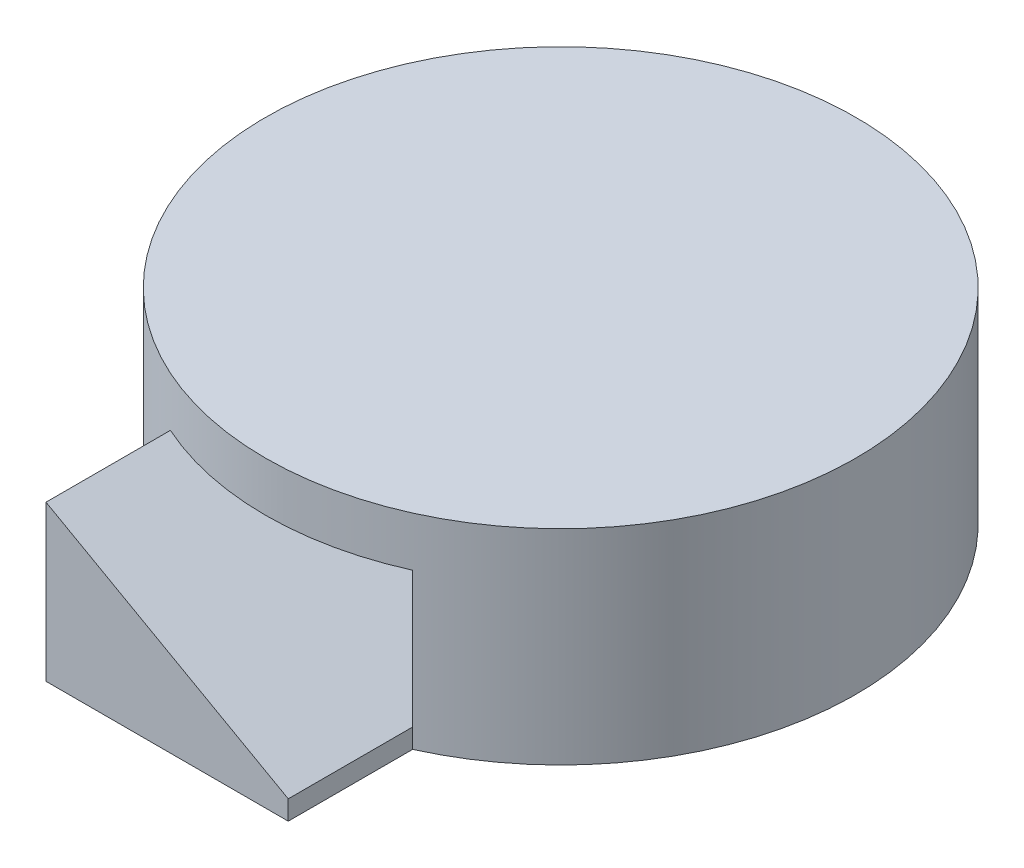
ISO-10303-21;
HEADER;
FILE_DESCRIPTION(('STEP AP214'),'2;1');
FILE_NAME('part.step','',(''),(''),'','','');
FILE_SCHEMA(('AUTOMOTIVE_DESIGN { 1 0 10303 214 1 1 1 1 }'));
ENDSEC;
DATA;
#1=APPLICATION_CONTEXT('core data for automotive mechanical design processes');
#2=APPLICATION_PROTOCOL_DEFINITION('international standard','automotive_design',2000,#1);
#3=PRODUCT_CONTEXT('',#1,'mechanical');
#4=PRODUCT('Part','Part','',(#3));
#5=PRODUCT_RELATED_PRODUCT_CATEGORY('part','',(#4));
#6=PRODUCT_DEFINITION_FORMATION('','',#4);
#7=PRODUCT_DEFINITION_CONTEXT('part definition',#1,'design');
#8=PRODUCT_DEFINITION('design','',#6,#7);
#9=PRODUCT_DEFINITION_SHAPE('','',#8);
#10=(LENGTH_UNIT() NAMED_UNIT(*) SI_UNIT(.MILLI.,.METRE.));
#11=(NAMED_UNIT(*) PLANE_ANGLE_UNIT() SI_UNIT($,.RADIAN.));
#12=(NAMED_UNIT(*) SI_UNIT($,.STERADIAN.) SOLID_ANGLE_UNIT());
#13=UNCERTAINTY_MEASURE_WITH_UNIT(LENGTH_MEASURE(1.E-05),#10,'distance_accuracy_value','');
#14=(GEOMETRIC_REPRESENTATION_CONTEXT(3) GLOBAL_UNCERTAINTY_ASSIGNED_CONTEXT((#13)) GLOBAL_UNIT_ASSIGNED_CONTEXT((#10,
#11,#12)) REPRESENTATION_CONTEXT('',''));
#15=CARTESIAN_POINT('',(0.,0.,0.));
#16=DIRECTION('',(0.,0.,1.));
#17=DIRECTION('',(1.,0.,0.));
#18=AXIS2_PLACEMENT_3D('',#15,#16,#17);
#19=CARTESIAN_POINT('',(0.,52.,0.));
#20=DIRECTION('',(0.,-1.,0.));
#21=DIRECTION('',(0.,0.,-1.));
#22=AXIS2_PLACEMENT_3D('',#19,#20,#21);
#23=CYLINDRICAL_SURFACE('',#22,75.);
#24=CARTESIAN_POINT('',(0.,22.1758581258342,0.));
#25=DIRECTION('',(-0.488920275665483,-0.872328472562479,0.));
#26=DIRECTION('',(0.872328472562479,-0.488920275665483,0.));
#27=AXIS2_PLACEMENT_3D('',#24,#25,#26);
#28=ELLIPSE('',#27,85.9767878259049,75.);
#29=CARTESIAN_POINT('',(30.7751152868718,4.92710570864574,-68.3951188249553));
#30=VERTEX_POINT('',#29);
#31=CARTESIAN_POINT('',(-30.7751152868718,39.4246105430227,-68.3951188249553));
#32=VERTEX_POINT('',#31);
#33=EDGE_CURVE('E41',#30,#32,#28,.F.);
#34=ORIENTED_EDGE('',*,*,#33,.F.);
#35=DIRECTION('',(0.,-1.,0.));
#36=VECTOR('',#35,1.);
#37=CARTESIAN_POINT('',(30.7751152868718,52.,-68.3951188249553));
#38=LINE('',#37,#36);
#39=CARTESIAN_POINT('',(30.7751152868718,39.4246105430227,-68.3951188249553));
#40=VERTEX_POINT('',#39);
#41=EDGE_CURVE('E135',#40,#30,#38,.T.);
#42=ORIENTED_EDGE('',*,*,#41,.F.);
#43=CARTESIAN_POINT('',(0.,39.4246105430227,0.));
#44=DIRECTION('',(0.,1.,0.));
#45=DIRECTION('',(0.,0.,1.));
#46=AXIS2_PLACEMENT_3D('',#43,#44,#45);
#47=CIRCLE('',#46,75.);
#48=EDGE_CURVE('E90',#32,#40,#47,.F.);
#49=ORIENTED_EDGE('',*,*,#48,.F.);
#50=EDGE_LOOP('',(#34,#42,#49));
#51=FACE_BOUND('',#50,.T.);
#52=CARTESIAN_POINT('',(0.,52.,0.));
#53=DIRECTION('',(0.,1.,0.));
#54=DIRECTION('',(0.,0.,1.));
#55=AXIS2_PLACEMENT_3D('',#52,#53,#54);
#56=CIRCLE('',#55,75.);
#57=CARTESIAN_POINT('',(0.,52.,75.));
#58=VERTEX_POINT('',#57);
#59=EDGE_CURVE('E11',#58,#58,#56,.T.);
#60=ORIENTED_EDGE('',*,*,#59,.F.);
#61=EDGE_LOOP('',(#60));
#62=FACE_BOUND('',#61,.T.);
#63=CARTESIAN_POINT('',(0.,0.,0.));
#64=DIRECTION('',(0.,1.,0.));
#65=DIRECTION('',(0.,0.,1.));
#66=AXIS2_PLACEMENT_3D('',#63,#64,#65);
#67=CIRCLE('',#66,75.);
#68=CARTESIAN_POINT('',(30.7751152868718,0.,68.3951188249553));
#69=VERTEX_POINT('',#68);
#70=CARTESIAN_POINT('',(-30.7751152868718,0.,68.3951188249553));
#71=VERTEX_POINT('',#70);
#72=EDGE_CURVE('E34',#69,#71,#67,.T.);
#73=ORIENTED_EDGE('',*,*,#72,.T.);
#74=DIRECTION('',(0.,-1.,0.));
#75=VECTOR('',#74,1.);
#76=CARTESIAN_POINT('',(-30.7751152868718,52.,68.3951188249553));
#77=LINE('',#76,#75);
#78=CARTESIAN_POINT('',(-30.7751152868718,39.4246105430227,68.3951188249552));
#79=VERTEX_POINT('',#78);
#80=EDGE_CURVE('E114',#79,#71,#77,.T.);
#81=ORIENTED_EDGE('',*,*,#80,.F.);
#82=CARTESIAN_POINT('',(0.,39.4246105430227,0.));
#83=DIRECTION('',(0.,1.,0.));
#84=DIRECTION('',(0.,0.,1.));
#85=AXIS2_PLACEMENT_3D('',#82,#83,#84);
#86=CIRCLE('',#85,75.);
#87=CARTESIAN_POINT('',(30.7751152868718,39.4246105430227,68.3951188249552));
#88=VERTEX_POINT('',#87);
#89=EDGE_CURVE('E119',#88,#79,#86,.F.);
#90=ORIENTED_EDGE('',*,*,#89,.F.);
#91=DIRECTION('',(0.,-1.,0.));
#92=VECTOR('',#91,1.);
#93=CARTESIAN_POINT('',(30.7751152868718,52.,68.3951188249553));
#94=LINE('',#93,#92);
#95=CARTESIAN_POINT('',(30.7751152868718,4.92710570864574,68.3951188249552));
#96=VERTEX_POINT('',#95);
#97=EDGE_CURVE('E109',#88,#96,#94,.T.);
#98=ORIENTED_EDGE('',*,*,#97,.T.);
#99=DIRECTION('',(0.,-1.,0.));
#100=VECTOR('',#99,1.);
#101=CARTESIAN_POINT('',(30.7751152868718,52.,68.3951188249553));
#102=LINE('',#101,#100);
#103=EDGE_CURVE('E99',#69,#96,#102,.F.);
#104=ORIENTED_EDGE('',*,*,#103,.F.);
#105=EDGE_LOOP('',(#73,#81,#90,#98,#104));
#106=FACE_BOUND('',#105,.T.);
#107=ADVANCED_FACE('F27',(#51,#62,#106),#23,.T.);
#108=CARTESIAN_POINT('',(0.,52.,0.));
#109=DIRECTION('',(0.,1.,0.));
#110=DIRECTION('',(0.,0.,1.));
#111=AXIS2_PLACEMENT_3D('',#108,#109,#110);
#112=PLANE('',#111);
#113=ORIENTED_EDGE('',*,*,#59,.T.);
#114=EDGE_LOOP('',(#113));
#115=FACE_BOUND('',#114,.T.);
#116=ADVANCED_FACE('F154',(#115),#112,.T.);
#117=CARTESIAN_POINT('',(0.,0.,0.));
#118=DIRECTION('',(0.,1.,0.));
#119=DIRECTION('',(0.,0.,1.));
#120=AXIS2_PLACEMENT_3D('',#117,#118,#119);
#121=PLANE('',#120);
#122=ORIENTED_EDGE('',*,*,#72,.F.);
#123=DIRECTION('',(0.,0.,1.));
#124=VECTOR('',#123,1.);
#125=CARTESIAN_POINT('',(30.7751152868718,0.,-75.001));
#126=LINE('',#125,#124);
#127=CARTESIAN_POINT('',(30.7751152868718,0.,100.));
#128=VERTEX_POINT('',#127);
#129=EDGE_CURVE('E113',#69,#128,#126,.T.);
#130=ORIENTED_EDGE('',*,*,#129,.T.);
#131=DIRECTION('',(1.,0.,0.));
#132=VECTOR('',#131,1.);
#133=CARTESIAN_POINT('',(-30.7751152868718,0.,100.));
#134=LINE('',#133,#132);
#135=CARTESIAN_POINT('',(-30.7751152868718,0.,100.));
#136=VERTEX_POINT('',#135);
#137=EDGE_CURVE('E104',#136,#128,#134,.T.);
#138=ORIENTED_EDGE('',*,*,#137,.F.);
#139=DIRECTION('',(0.,0.,1.));
#140=VECTOR('',#139,1.);
#141=CARTESIAN_POINT('',(-30.7751152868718,0.,-75.001));
#142=LINE('',#141,#140);
#143=EDGE_CURVE('E116',#71,#136,#142,.T.);
#144=ORIENTED_EDGE('',*,*,#143,.F.);
#145=EDGE_LOOP('',(#122,#130,#138,#144));
#146=FACE_BOUND('',#145,.T.);
#147=ADVANCED_FACE('F123',(#146),#121,.F.);
#148=CARTESIAN_POINT('',(-30.7751152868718,39.4246105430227,-75.001));
#149=DIRECTION('',(-1.,0.,0.));
#150=DIRECTION('',(0.,-1.,0.));
#151=AXIS2_PLACEMENT_3D('',#148,#149,#150);
#152=PLANE('',#151);
#153=DIRECTION('',(0.,0.,1.));
#154=VECTOR('',#153,1.);
#155=CARTESIAN_POINT('',(-30.7751152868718,39.4246105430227,-75.001));
#156=LINE('',#155,#154);
#157=CARTESIAN_POINT('',(-30.7751152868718,39.4246105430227,100.));
#158=VERTEX_POINT('',#157);
#159=EDGE_CURVE('E84',#79,#158,#156,.T.);
#160=ORIENTED_EDGE('',*,*,#159,.F.);
#161=ORIENTED_EDGE('',*,*,#80,.T.);
#162=ORIENTED_EDGE('',*,*,#143,.T.);
#163=DIRECTION('',(0.,-1.,0.));
#164=VECTOR('',#163,1.);
#165=CARTESIAN_POINT('',(-30.7751152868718,39.4246105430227,100.));
#166=LINE('',#165,#164);
#167=EDGE_CURVE('E106',#158,#136,#166,.T.);
#168=ORIENTED_EDGE('',*,*,#167,.F.);
#169=EDGE_LOOP('',(#160,#161,#162,#168));
#170=FACE_BOUND('',#169,.T.);
#171=ADVANCED_FACE('F145',(#170),#152,.T.);
#172=CARTESIAN_POINT('',(30.7751152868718,39.4246105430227,-75.001));
#173=DIRECTION('',(1.,0.,0.));
#174=DIRECTION('',(0.,1.,0.));
#175=AXIS2_PLACEMENT_3D('',#172,#173,#174);
#176=PLANE('',#175);
#177=DIRECTION('',(0.,0.,1.));
#178=VECTOR('',#177,1.);
#179=CARTESIAN_POINT('',(30.7751152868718,4.92710570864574,-75.001));
#180=LINE('',#179,#178);
#181=CARTESIAN_POINT('',(30.7751152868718,4.92710570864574,100.));
#182=VERTEX_POINT('',#181);
#183=EDGE_CURVE('E81',#96,#182,#180,.T.);
#184=ORIENTED_EDGE('',*,*,#183,.T.);
#185=DIRECTION('',(0.,1.,0.));
#186=VECTOR('',#185,1.);
#187=CARTESIAN_POINT('',(30.7751152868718,39.4246105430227,100.));
#188=LINE('',#187,#186);
#189=EDGE_CURVE('E97',#128,#182,#188,.T.);
#190=ORIENTED_EDGE('',*,*,#189,.F.);
#191=ORIENTED_EDGE('',*,*,#129,.F.);
#192=ORIENTED_EDGE('',*,*,#103,.T.);
#193=EDGE_LOOP('',(#184,#190,#191,#192));
#194=FACE_BOUND('',#193,.T.);
#195=ADVANCED_FACE('F95',(#194),#176,.T.);
#196=CARTESIAN_POINT('',(-30.7751152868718,0.,100.));
#197=DIRECTION('',(0.,0.,1.));
#198=DIRECTION('',(1.,0.,0.));
#199=AXIS2_PLACEMENT_3D('',#196,#197,#198);
#200=PLANE('',#199);
#201=DIRECTION('',(0.872328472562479,-0.488920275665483,0.));
#202=VECTOR('',#201,1.);
#203=CARTESIAN_POINT('',(-30.7751152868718,39.4246105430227,100.));
#204=LINE('',#203,#202);
#205=EDGE_CURVE('E78',#158,#182,#204,.T.);
#206=ORIENTED_EDGE('',*,*,#205,.F.);
#207=ORIENTED_EDGE('',*,*,#167,.T.);
#208=ORIENTED_EDGE('',*,*,#137,.T.);
#209=ORIENTED_EDGE('',*,*,#189,.T.);
#210=EDGE_LOOP('',(#206,#207,#208,#209));
#211=FACE_BOUND('',#210,.T.);
#212=ADVANCED_FACE('F102',(#211),#200,.T.);
#213=CARTESIAN_POINT('',(30.7751152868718,4.92710570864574,-75.001));
#214=DIRECTION('',(1.,0.,0.));
#215=DIRECTION('',(0.,0.,-1.));
#216=AXIS2_PLACEMENT_3D('',#213,#214,#215);
#217=PLANE('',#216);
#218=DIRECTION('',(0.,0.,1.));
#219=VECTOR('',#218,1.);
#220=CARTESIAN_POINT('',(30.7751152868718,39.4246105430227,-75.001));
#221=LINE('',#220,#219);
#222=EDGE_CURVE('E129',#40,#88,#221,.T.);
#223=ORIENTED_EDGE('',*,*,#222,.F.);
#224=ORIENTED_EDGE('',*,*,#41,.T.);
#225=EDGE_CURVE('E100',#30,#96,#180,.T.);
#226=ORIENTED_EDGE('',*,*,#225,.T.);
#227=ORIENTED_EDGE('',*,*,#97,.F.);
#228=EDGE_LOOP('',(#223,#224,#226,#227));
#229=FACE_BOUND('',#228,.T.);
#230=ADVANCED_FACE('F138',(#229),#217,.F.);
#231=CARTESIAN_POINT('',(30.7751152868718,39.4246105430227,-75.001));
#232=DIRECTION('',(0.,1.,0.));
#233=DIRECTION('',(0.,0.,1.));
#234=AXIS2_PLACEMENT_3D('',#231,#232,#233);
#235=PLANE('',#234);
#236=DIRECTION('',(0.,0.,1.));
#237=VECTOR('',#236,1.);
#238=CARTESIAN_POINT('',(-30.7751152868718,39.4246105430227,-75.001));
#239=LINE('',#238,#237);
#240=EDGE_CURVE('E89',#32,#79,#239,.T.);
#241=ORIENTED_EDGE('',*,*,#240,.F.);
#242=ORIENTED_EDGE('',*,*,#48,.T.);
#243=ORIENTED_EDGE('',*,*,#222,.T.);
#244=ORIENTED_EDGE('',*,*,#89,.T.);
#245=EDGE_LOOP('',(#241,#242,#243,#244));
#246=FACE_BOUND('',#245,.T.);
#247=ADVANCED_FACE('F143',(#246),#235,.F.);
#248=CARTESIAN_POINT('',(-30.7751152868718,39.4246105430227,-75.001));
#249=DIRECTION('',(-0.488920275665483,-0.872328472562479,0.));
#250=DIRECTION('',(0.872328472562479,-0.488920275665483,0.));
#251=AXIS2_PLACEMENT_3D('',#248,#249,#250);
#252=PLANE('',#251);
#253=ORIENTED_EDGE('',*,*,#33,.T.);
#254=ORIENTED_EDGE('',*,*,#240,.T.);
#255=ORIENTED_EDGE('',*,*,#159,.T.);
#256=ORIENTED_EDGE('',*,*,#205,.T.);
#257=ORIENTED_EDGE('',*,*,#183,.F.);
#258=ORIENTED_EDGE('',*,*,#225,.F.);
#259=EDGE_LOOP('',(#253,#254,#255,#256,#257,#258));
#260=FACE_BOUND('',#259,.T.);
#261=ADVANCED_FACE('F80',(#260),#252,.F.);
#262=CLOSED_SHELL('',(#107,#116,#147,#171,#195,#212,#230,#247,#261));
#263=MANIFOLD_SOLID_BREP('B2',#262);
#264=ADVANCED_BREP_SHAPE_REPRESENTATION('',(#18,#263),#14);
#265=SHAPE_DEFINITION_REPRESENTATION(#9,#264);
ENDSEC;
END-ISO-10303-21;
